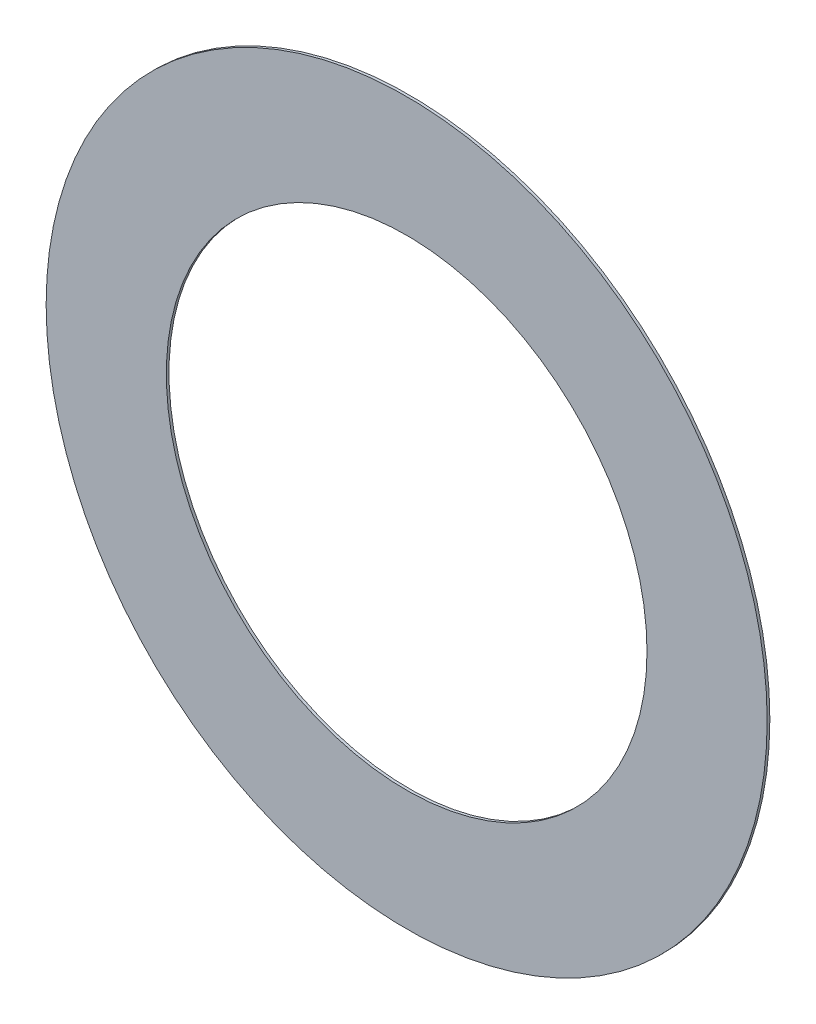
ISO-10303-21;
HEADER;
FILE_DESCRIPTION(('STEP AP214'),'2;1');
FILE_NAME('part.step','',(''),(''),'','','');
FILE_SCHEMA(('AUTOMOTIVE_DESIGN { 1 0 10303 214 1 1 1 1 }'));
ENDSEC;
DATA;
#1=APPLICATION_CONTEXT('core data for automotive mechanical design processes');
#2=APPLICATION_PROTOCOL_DEFINITION('international standard','automotive_design',2000,#1);
#3=PRODUCT_CONTEXT('',#1,'mechanical');
#4=PRODUCT('Part','Part','',(#3));
#5=PRODUCT_RELATED_PRODUCT_CATEGORY('part','',(#4));
#6=PRODUCT_DEFINITION_FORMATION('','',#4);
#7=PRODUCT_DEFINITION_CONTEXT('part definition',#1,'design');
#8=PRODUCT_DEFINITION('design','',#6,#7);
#9=PRODUCT_DEFINITION_SHAPE('','',#8);
#10=(LENGTH_UNIT() NAMED_UNIT(*) SI_UNIT(.MILLI.,.METRE.));
#11=(NAMED_UNIT(*) PLANE_ANGLE_UNIT() SI_UNIT($,.RADIAN.));
#12=(NAMED_UNIT(*) SI_UNIT($,.STERADIAN.) SOLID_ANGLE_UNIT());
#13=UNCERTAINTY_MEASURE_WITH_UNIT(LENGTH_MEASURE(1.E-05),#10,'distance_accuracy_value','');
#14=(GEOMETRIC_REPRESENTATION_CONTEXT(3) GLOBAL_UNCERTAINTY_ASSIGNED_CONTEXT((#13)) GLOBAL_UNIT_ASSIGNED_CONTEXT((#10,
#11,#12)) REPRESENTATION_CONTEXT('',''));
#15=CARTESIAN_POINT('',(0.,0.,0.));
#16=DIRECTION('',(0.,0.,1.));
#17=DIRECTION('',(1.,0.,0.));
#18=AXIS2_PLACEMENT_3D('',#15,#16,#17);
#19=CARTESIAN_POINT('',(0.,0.,0.05));
#20=DIRECTION('',(0.,0.,1.));
#21=DIRECTION('',(1.,0.,0.));
#22=AXIS2_PLACEMENT_3D('',#19,#20,#21);
#23=PLANE('',#22);
#24=CARTESIAN_POINT('',(0.,0.,0.05));
#25=DIRECTION('',(0.,0.,1.));
#26=DIRECTION('',(1.,0.,0.));
#27=AXIS2_PLACEMENT_3D('',#24,#25,#26);
#28=CIRCLE('',#27,6.75000000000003);
#29=CARTESIAN_POINT('',(6.75000000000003,0.,0.05));
#30=VERTEX_POINT('',#29);
#31=EDGE_CURVE('E10',#30,#30,#28,.T.);
#32=ORIENTED_EDGE('',*,*,#31,.T.);
#33=EDGE_LOOP('',(#32));
#34=FACE_BOUND('',#33,.T.);
#35=CARTESIAN_POINT('',(0.,0.,0.05));
#36=DIRECTION('',(0.,0.,1.));
#37=DIRECTION('',(1.,0.,0.));
#38=AXIS2_PLACEMENT_3D('',#35,#36,#37);
#39=CIRCLE('',#38,4.50000000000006);
#40=CARTESIAN_POINT('',(4.50000000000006,0.,0.05));
#41=VERTEX_POINT('',#40);
#42=EDGE_CURVE('E42',#41,#41,#39,.T.);
#43=ORIENTED_EDGE('',*,*,#42,.F.);
#44=EDGE_LOOP('',(#43));
#45=FACE_BOUND('',#44,.T.);
#46=ADVANCED_FACE('F31',(#34,#45),#23,.T.);
#47=CARTESIAN_POINT('',(0.,0.,0.));
#48=DIRECTION('',(0.,0.,1.));
#49=DIRECTION('',(1.,0.,0.));
#50=AXIS2_PLACEMENT_3D('',#47,#48,#49);
#51=PLANE('',#50);
#52=CARTESIAN_POINT('',(0.,0.,0.));
#53=DIRECTION('',(0.,0.,1.));
#54=DIRECTION('',(1.,0.,0.));
#55=AXIS2_PLACEMENT_3D('',#52,#53,#54);
#56=CIRCLE('',#55,6.75000000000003);
#57=CARTESIAN_POINT('',(6.75000000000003,0.,0.));
#58=VERTEX_POINT('',#57);
#59=EDGE_CURVE('E35',#58,#58,#56,.T.);
#60=ORIENTED_EDGE('',*,*,#59,.F.);
#61=EDGE_LOOP('',(#60));
#62=FACE_BOUND('',#61,.T.);
#63=CARTESIAN_POINT('',(0.,0.,0.));
#64=DIRECTION('',(0.,0.,1.));
#65=DIRECTION('',(1.,0.,0.));
#66=AXIS2_PLACEMENT_3D('',#63,#64,#65);
#67=CIRCLE('',#66,4.50000000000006);
#68=CARTESIAN_POINT('',(4.50000000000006,0.,0.));
#69=VERTEX_POINT('',#68);
#70=EDGE_CURVE('E44',#69,#69,#67,.T.);
#71=ORIENTED_EDGE('',*,*,#70,.T.);
#72=EDGE_LOOP('',(#71));
#73=FACE_BOUND('',#72,.T.);
#74=ADVANCED_FACE('F54',(#62,#73),#51,.F.);
#75=CARTESIAN_POINT('',(0.,0.,0.05));
#76=DIRECTION('',(0.,0.,-1.));
#77=DIRECTION('',(-1.,0.,0.));
#78=AXIS2_PLACEMENT_3D('',#75,#76,#77);
#79=CYLINDRICAL_SURFACE('',#78,6.75000000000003);
#80=ORIENTED_EDGE('',*,*,#31,.F.);
#81=EDGE_LOOP('',(#80));
#82=FACE_BOUND('',#81,.T.);
#83=ORIENTED_EDGE('',*,*,#59,.T.);
#84=EDGE_LOOP('',(#83));
#85=FACE_BOUND('',#84,.T.);
#86=ADVANCED_FACE('F33',(#82,#85),#79,.T.);
#87=CARTESIAN_POINT('',(0.,0.,0.05));
#88=DIRECTION('',(0.,0.,-1.));
#89=DIRECTION('',(-1.,0.,0.));
#90=AXIS2_PLACEMENT_3D('',#87,#88,#89);
#91=CYLINDRICAL_SURFACE('',#90,4.50000000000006);
#92=ORIENTED_EDGE('',*,*,#42,.T.);
#93=EDGE_LOOP('',(#92));
#94=FACE_BOUND('',#93,.T.);
#95=ORIENTED_EDGE('',*,*,#70,.F.);
#96=EDGE_LOOP('',(#95));
#97=FACE_BOUND('',#96,.T.);
#98=ADVANCED_FACE('F50',(#94,#97),#91,.F.);
#99=CLOSED_SHELL('',(#46,#74,#86,#98));
#100=MANIFOLD_SOLID_BREP('B2',#99);
#101=ADVANCED_BREP_SHAPE_REPRESENTATION('',(#18,#100),#14);
#102=SHAPE_DEFINITION_REPRESENTATION(#9,#101);
ENDSEC;
END-ISO-10303-21;
